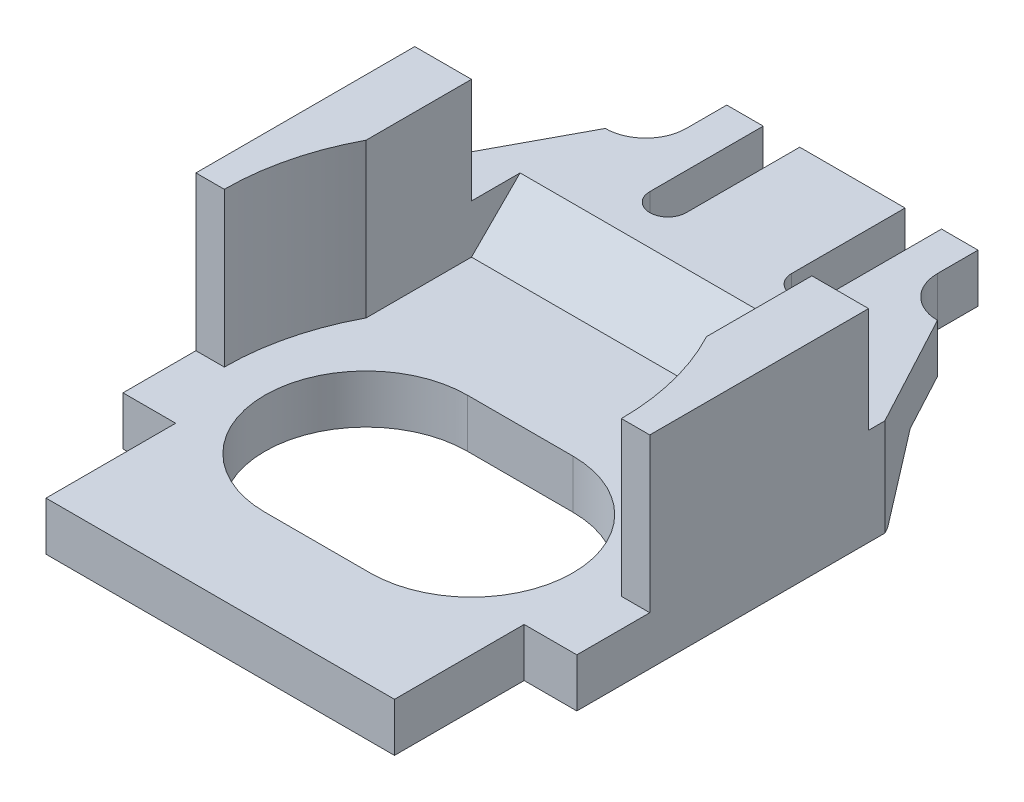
ISO-10303-21;
HEADER;
FILE_DESCRIPTION(('STEP AP214'),'2;1');
FILE_NAME('part.step','',(''),(''),'','','');
FILE_SCHEMA(('AUTOMOTIVE_DESIGN { 1 0 10303 214 1 1 1 1 }'));
ENDSEC;
DATA;
#1=APPLICATION_CONTEXT('core data for automotive mechanical design processes');
#2=APPLICATION_PROTOCOL_DEFINITION('international standard','automotive_design',2000,#1);
#3=PRODUCT_CONTEXT('',#1,'mechanical');
#4=PRODUCT('Part','Part','',(#3));
#5=PRODUCT_RELATED_PRODUCT_CATEGORY('part','',(#4));
#6=PRODUCT_DEFINITION_FORMATION('','',#4);
#7=PRODUCT_DEFINITION_CONTEXT('part definition',#1,'design');
#8=PRODUCT_DEFINITION('design','',#6,#7);
#9=PRODUCT_DEFINITION_SHAPE('','',#8);
#10=(LENGTH_UNIT() NAMED_UNIT(*) SI_UNIT(.MILLI.,.METRE.));
#11=(NAMED_UNIT(*) PLANE_ANGLE_UNIT() SI_UNIT($,.RADIAN.));
#12=(NAMED_UNIT(*) SI_UNIT($,.STERADIAN.) SOLID_ANGLE_UNIT());
#13=UNCERTAINTY_MEASURE_WITH_UNIT(LENGTH_MEASURE(1.E-05),#10,'distance_accuracy_value','');
#14=(GEOMETRIC_REPRESENTATION_CONTEXT(3) GLOBAL_UNCERTAINTY_ASSIGNED_CONTEXT((#13)) GLOBAL_UNIT_ASSIGNED_CONTEXT((#10,
#11,#12)) REPRESENTATION_CONTEXT('',''));
#15=CARTESIAN_POINT('',(0.,0.,0.));
#16=DIRECTION('',(0.,0.,1.));
#17=DIRECTION('',(1.,0.,0.));
#18=AXIS2_PLACEMENT_3D('',#15,#16,#17);
#19=CARTESIAN_POINT('',(-28.,0.,24.5));
#20=DIRECTION('',(0.,-1.,0.));
#21=DIRECTION('',(0.,0.,-1.));
#22=AXIS2_PLACEMENT_3D('',#19,#20,#21);
#23=PLANE('',#22);
#24=CARTESIAN_POINT('',(-6.5,0.,0.));
#25=DIRECTION('',(0.,-1.,0.));
#26=DIRECTION('',(0.,0.,-1.));
#27=AXIS2_PLACEMENT_3D('',#24,#25,#26);
#28=CIRCLE('',#27,12.5);
#29=CARTESIAN_POINT('',(-6.5,0.,12.5));
#30=VERTEX_POINT('',#29);
#31=CARTESIAN_POINT('',(-6.5,0.,-12.5));
#32=VERTEX_POINT('',#31);
#33=EDGE_CURVE('E332',#30,#32,#28,.T.);
#34=ORIENTED_EDGE('',*,*,#33,.T.);
#35=DIRECTION('',(1.,0.,0.));
#36=VECTOR('',#35,1.);
#37=CARTESIAN_POINT('',(-6.5,0.,-12.5));
#38=LINE('',#37,#36);
#39=CARTESIAN_POINT('',(6.5,0.,-12.5));
#40=VERTEX_POINT('',#39);
#41=EDGE_CURVE('E473',#32,#40,#38,.T.);
#42=ORIENTED_EDGE('',*,*,#41,.T.);
#43=CARTESIAN_POINT('',(6.5,0.,0.));
#44=DIRECTION('',(0.,-1.,0.));
#45=DIRECTION('',(0.,0.,-1.));
#46=AXIS2_PLACEMENT_3D('',#43,#44,#45);
#47=CIRCLE('',#46,12.5);
#48=CARTESIAN_POINT('',(6.5,0.,12.5));
#49=VERTEX_POINT('',#48);
#50=EDGE_CURVE('E325',#40,#49,#47,.T.);
#51=ORIENTED_EDGE('',*,*,#50,.T.);
#52=DIRECTION('',(-1.,0.,0.));
#53=VECTOR('',#52,1.);
#54=CARTESIAN_POINT('',(-6.5,0.,12.5));
#55=LINE('',#54,#53);
#56=EDGE_CURVE('E330',#49,#30,#55,.T.);
#57=ORIENTED_EDGE('',*,*,#56,.T.);
#58=EDGE_LOOP('',(#34,#42,#51,#57));
#59=FACE_BOUND('',#58,.T.);
#60=CARTESIAN_POINT('',(5.25,0.,-0.499999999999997));
#61=DIRECTION('',(0.,1.,0.));
#62=DIRECTION('',(0.,0.,-1.));
#63=AXIS2_PLACEMENT_3D('',#60,#61,#62);
#64=CIRCLE('',#63,29.75);
#65=CARTESIAN_POINT('',(-21.,0.,-14.5));
#66=VERTEX_POINT('',#65);
#67=CARTESIAN_POINT('',(-24.5,0.,-0.499999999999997));
#68=VERTEX_POINT('',#67);
#69=EDGE_CURVE('E307',#66,#68,#64,.T.);
#70=ORIENTED_EDGE('',*,*,#69,.T.);
#71=DIRECTION('',(-1.,0.,0.));
#72=VECTOR('',#71,1.);
#73=CARTESIAN_POINT('',(-28.,0.,-0.499999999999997));
#74=LINE('',#73,#72);
#75=CARTESIAN_POINT('',(-28.,0.,-0.499999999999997));
#76=VERTEX_POINT('',#75);
#77=EDGE_CURVE('E291',#68,#76,#74,.T.);
#78=ORIENTED_EDGE('',*,*,#77,.T.);
#79=DIRECTION('',(0.,0.,-1.));
#80=VECTOR('',#79,1.);
#81=CARTESIAN_POINT('',(-28.,0.,24.5));
#82=LINE('',#81,#80);
#83=CARTESIAN_POINT('',(-28.,0.,8.49999999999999));
#84=VERTEX_POINT('',#83);
#85=EDGE_CURVE('E303',#84,#76,#82,.T.);
#86=ORIENTED_EDGE('',*,*,#85,.F.);
#87=DIRECTION('',(-1.,0.,0.));
#88=VECTOR('',#87,1.);
#89=CARTESIAN_POINT('',(-28.,0.,8.49999999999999));
#90=LINE('',#89,#88);
#91=CARTESIAN_POINT('',(-21.5,0.,8.49999999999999));
#92=VERTEX_POINT('',#91);
#93=EDGE_CURVE('E343',#92,#84,#90,.T.);
#94=ORIENTED_EDGE('',*,*,#93,.F.);
#95=DIRECTION('',(0.,0.,-1.));
#96=VECTOR('',#95,1.);
#97=CARTESIAN_POINT('',(-21.5,0.,8.49999999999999));
#98=LINE('',#97,#96);
#99=CARTESIAN_POINT('',(-21.5,0.,24.5));
#100=VERTEX_POINT('',#99);
#101=EDGE_CURVE('E340',#100,#92,#98,.T.);
#102=ORIENTED_EDGE('',*,*,#101,.F.);
#103=DIRECTION('',(1.,0.,0.));
#104=VECTOR('',#103,1.);
#105=CARTESIAN_POINT('',(-28.,0.,24.5));
#106=LINE('',#105,#104);
#107=CARTESIAN_POINT('',(21.5,0.,24.5));
#108=VERTEX_POINT('',#107);
#109=EDGE_CURVE('E313',#100,#108,#106,.T.);
#110=ORIENTED_EDGE('',*,*,#109,.T.);
#111=DIRECTION('',(0.,0.,1.));
#112=VECTOR('',#111,1.);
#113=CARTESIAN_POINT('',(21.5,0.,8.49999999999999));
#114=LINE('',#113,#112);
#115=CARTESIAN_POINT('',(21.5,0.,8.49999999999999));
#116=VERTEX_POINT('',#115);
#117=EDGE_CURVE('E337',#116,#108,#114,.T.);
#118=ORIENTED_EDGE('',*,*,#117,.F.);
#119=DIRECTION('',(-1.,0.,0.));
#120=VECTOR('',#119,1.);
#121=CARTESIAN_POINT('',(28.,0.,8.49999999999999));
#122=LINE('',#121,#120);
#123=CARTESIAN_POINT('',(28.,0.,8.49999999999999));
#124=VERTEX_POINT('',#123);
#125=EDGE_CURVE('E334',#124,#116,#122,.T.);
#126=ORIENTED_EDGE('',*,*,#125,.F.);
#127=DIRECTION('',(0.,0.,-1.));
#128=VECTOR('',#127,1.);
#129=CARTESIAN_POINT('',(28.,0.,24.5));
#130=LINE('',#129,#128);
#131=CARTESIAN_POINT('',(28.,0.,-0.499999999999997));
#132=VERTEX_POINT('',#131);
#133=EDGE_CURVE('E314',#124,#132,#130,.T.);
#134=ORIENTED_EDGE('',*,*,#133,.T.);
#135=DIRECTION('',(1.,0.,0.));
#136=VECTOR('',#135,1.);
#137=CARTESIAN_POINT('',(28.,0.,-0.499999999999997));
#138=LINE('',#137,#136);
#139=CARTESIAN_POINT('',(24.5,0.,-0.499999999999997));
#140=VERTEX_POINT('',#139);
#141=EDGE_CURVE('E598',#140,#132,#138,.T.);
#142=ORIENTED_EDGE('',*,*,#141,.F.);
#143=CARTESIAN_POINT('',(-5.25,0.,-0.499999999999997));
#144=DIRECTION('',(0.,-1.,0.));
#145=DIRECTION('',(0.,0.,-1.));
#146=AXIS2_PLACEMENT_3D('',#143,#144,#145);
#147=CIRCLE('',#146,29.75);
#148=CARTESIAN_POINT('',(21.,0.,-14.5));
#149=VERTEX_POINT('',#148);
#150=EDGE_CURVE('E592',#149,#140,#147,.T.);
#151=ORIENTED_EDGE('',*,*,#150,.F.);
#152=DIRECTION('',(0.,0.,1.));
#153=VECTOR('',#152,1.);
#154=CARTESIAN_POINT('',(21.,0.,-14.5));
#155=LINE('',#154,#153);
#156=CARTESIAN_POINT('',(21.,0.,-27.5));
#157=VERTEX_POINT('',#156);
#158=EDGE_CURVE('E589',#157,#149,#155,.T.);
#159=ORIENTED_EDGE('',*,*,#158,.F.);
#160=DIRECTION('',(1.,0.,0.));
#161=VECTOR('',#160,1.);
#162=CARTESIAN_POINT('',(-28.,0.,-27.5));
#163=LINE('',#162,#161);
#164=CARTESIAN_POINT('',(-21.,0.,-27.5));
#165=VERTEX_POINT('',#164);
#166=EDGE_CURVE('E316',#165,#157,#163,.T.);
#167=ORIENTED_EDGE('',*,*,#166,.F.);
#168=DIRECTION('',(0.,0.,1.));
#169=VECTOR('',#168,1.);
#170=CARTESIAN_POINT('',(-21.,0.,-14.5));
#171=LINE('',#170,#169);
#172=EDGE_CURVE('E753',#165,#66,#171,.T.);
#173=ORIENTED_EDGE('',*,*,#172,.T.);
#174=EDGE_LOOP('',(#70,#78,#86,#94,#102,#110,#118,#126,#134,#142,#151,#159,#167,#173));
#175=FACE_BOUND('',#174,.T.);
#176=ADVANCED_FACE('F33',(#59,#175),#23,.F.);
#177=CARTESIAN_POINT('',(-8.75,6.,-39.5));
#178=DIRECTION('',(0.,-1.,0.));
#179=DIRECTION('',(0.,0.,-1.));
#180=AXIS2_PLACEMENT_3D('',#177,#178,#179);
#181=PLANE('',#180);
#182=DIRECTION('',(1.,0.,0.));
#183=VECTOR('',#182,1.);
#184=CARTESIAN_POINT('',(-8.75,6.,-33.5000000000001));
#185=LINE('',#184,#183);
#186=CARTESIAN_POINT('',(-21.,6.,-33.5000000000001));
#187=VERTEX_POINT('',#186);
#188=CARTESIAN_POINT('',(21.,6.,-33.5000000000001));
#189=VERTEX_POINT('',#188);
#190=EDGE_CURVE('E484',#187,#189,#185,.T.);
#191=ORIENTED_EDGE('',*,*,#190,.T.);
#192=DIRECTION('',(0.,0.,1.));
#193=VECTOR('',#192,1.);
#194=CARTESIAN_POINT('',(21.,6.,-39.5));
#195=LINE('',#194,#193);
#196=CARTESIAN_POINT('',(21.,6.,-27.5));
#197=VERTEX_POINT('',#196);
#198=EDGE_CURVE('E487',#189,#197,#195,.T.);
#199=ORIENTED_EDGE('',*,*,#198,.T.);
#200=DIRECTION('',(1.,0.,0.));
#201=VECTOR('',#200,1.);
#202=CARTESIAN_POINT('',(-28.,6.,-27.5));
#203=LINE('',#202,#201);
#204=CARTESIAN_POINT('',(28.,6.,-27.5));
#205=VERTEX_POINT('',#204);
#206=EDGE_CURVE('E326',#197,#205,#203,.T.);
#207=ORIENTED_EDGE('',*,*,#206,.T.);
#208=DIRECTION('',(0.,0.,-1.));
#209=VECTOR('',#208,1.);
#210=CARTESIAN_POINT('',(28.,6.,8.49999999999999));
#211=LINE('',#210,#209);
#212=CARTESIAN_POINT('',(28.,6.,-29.5));
#213=VERTEX_POINT('',#212);
#214=EDGE_CURVE('E392',#205,#213,#211,.T.);
#215=ORIENTED_EDGE('',*,*,#214,.T.);
#216=DIRECTION('',(-0.472221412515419,0.,-0.881479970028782));
#217=VECTOR('',#216,1.);
#218=CARTESIAN_POINT('',(28.,6.,-29.5));
#219=LINE('',#218,#217);
#220=CARTESIAN_POINT('',(20.5,6.,-43.5));
#221=VERTEX_POINT('',#220);
#222=EDGE_CURVE('E394',#213,#221,#219,.T.);
#223=ORIENTED_EDGE('',*,*,#222,.T.);
#224=CARTESIAN_POINT('',(20.5,6.,-48.5));
#225=DIRECTION('',(0.,-1.,0.));
#226=DIRECTION('',(0.,0.,-1.));
#227=AXIS2_PLACEMENT_3D('',#224,#225,#226);
#228=CIRCLE('',#227,5.);
#229=CARTESIAN_POINT('',(15.5,6.,-48.5));
#230=VERTEX_POINT('',#229);
#231=EDGE_CURVE('E11',#221,#230,#228,.T.);
#232=ORIENTED_EDGE('',*,*,#231,.T.);
#233=DIRECTION('',(0.,0.,-1.));
#234=VECTOR('',#233,1.);
#235=CARTESIAN_POINT('',(15.5,6.,-43.5));
#236=LINE('',#235,#234);
#237=CARTESIAN_POINT('',(15.5,6.,-53.5));
#238=VERTEX_POINT('',#237);
#239=EDGE_CURVE('E396',#230,#238,#236,.T.);
#240=ORIENTED_EDGE('',*,*,#239,.T.);
#241=DIRECTION('',(-1.,0.,0.));
#242=VECTOR('',#241,1.);
#243=CARTESIAN_POINT('',(11.,6.,-53.5));
#244=LINE('',#243,#242);
#245=CARTESIAN_POINT('',(11.,6.,-53.5));
#246=VERTEX_POINT('',#245);
#247=EDGE_CURVE('E398',#238,#246,#244,.T.);
#248=ORIENTED_EDGE('',*,*,#247,.T.);
#249=DIRECTION('',(0.,0.,1.));
#250=VECTOR('',#249,1.);
#251=CARTESIAN_POINT('',(11.,6.,-53.5));
#252=LINE('',#251,#250);
#253=CARTESIAN_POINT('',(11.,6.,-39.5));
#254=VERTEX_POINT('',#253);
#255=EDGE_CURVE('E400',#246,#254,#252,.T.);
#256=ORIENTED_EDGE('',*,*,#255,.T.);
#257=CARTESIAN_POINT('',(8.75,6.,-39.5));
#258=DIRECTION('',(0.,-1.,0.));
#259=DIRECTION('',(0.,0.,1.));
#260=AXIS2_PLACEMENT_3D('',#257,#258,#259);
#261=CIRCLE('',#260,2.25);
#262=CARTESIAN_POINT('',(6.5,6.,-39.5));
#263=VERTEX_POINT('',#262);
#264=EDGE_CURVE('E402',#254,#263,#261,.T.);
#265=ORIENTED_EDGE('',*,*,#264,.T.);
#266=DIRECTION('',(0.,0.,-1.));
#267=VECTOR('',#266,1.);
#268=CARTESIAN_POINT('',(6.5,6.,-53.5));
#269=LINE('',#268,#267);
#270=CARTESIAN_POINT('',(6.5,6.,-53.5));
#271=VERTEX_POINT('',#270);
#272=EDGE_CURVE('E404',#263,#271,#269,.T.);
#273=ORIENTED_EDGE('',*,*,#272,.T.);
#274=DIRECTION('',(-1.,0.,0.));
#275=VECTOR('',#274,1.);
#276=CARTESIAN_POINT('',(6.5,6.,-53.5));
#277=LINE('',#276,#275);
#278=CARTESIAN_POINT('',(-6.5,6.,-53.5));
#279=VERTEX_POINT('',#278);
#280=EDGE_CURVE('E406',#271,#279,#277,.T.);
#281=ORIENTED_EDGE('',*,*,#280,.T.);
#282=DIRECTION('',(0.,0.,1.));
#283=VECTOR('',#282,1.);
#284=CARTESIAN_POINT('',(-6.5,6.,-53.5));
#285=LINE('',#284,#283);
#286=CARTESIAN_POINT('',(-6.5,6.,-39.5));
#287=VERTEX_POINT('',#286);
#288=EDGE_CURVE('E408',#279,#287,#285,.T.);
#289=ORIENTED_EDGE('',*,*,#288,.T.);
#290=CARTESIAN_POINT('',(-8.75,6.,-39.5));
#291=DIRECTION('',(0.,-1.,0.));
#292=DIRECTION('',(0.,0.,-1.));
#293=AXIS2_PLACEMENT_3D('',#290,#291,#292);
#294=CIRCLE('',#293,2.25);
#295=CARTESIAN_POINT('',(-11.,6.,-39.5));
#296=VERTEX_POINT('',#295);
#297=EDGE_CURVE('E410',#287,#296,#294,.T.);
#298=ORIENTED_EDGE('',*,*,#297,.T.);
#299=DIRECTION('',(0.,0.,-1.));
#300=VECTOR('',#299,1.);
#301=CARTESIAN_POINT('',(-11.,6.,-53.5));
#302=LINE('',#301,#300);
#303=CARTESIAN_POINT('',(-11.,6.,-53.5));
#304=VERTEX_POINT('',#303);
#305=EDGE_CURVE('E412',#296,#304,#302,.T.);
#306=ORIENTED_EDGE('',*,*,#305,.T.);
#307=DIRECTION('',(-1.,0.,0.));
#308=VECTOR('',#307,1.);
#309=CARTESIAN_POINT('',(-15.5,6.,-53.5));
#310=LINE('',#309,#308);
#311=CARTESIAN_POINT('',(-15.5,6.,-53.5));
#312=VERTEX_POINT('',#311);
#313=EDGE_CURVE('E414',#304,#312,#310,.T.);
#314=ORIENTED_EDGE('',*,*,#313,.T.);
#315=DIRECTION('',(0.,0.,1.));
#316=VECTOR('',#315,1.);
#317=CARTESIAN_POINT('',(-15.5,6.,-43.5));
#318=LINE('',#317,#316);
#319=CARTESIAN_POINT('',(-15.5,6.,-48.5));
#320=VERTEX_POINT('',#319);
#321=EDGE_CURVE('E416',#312,#320,#318,.T.);
#322=ORIENTED_EDGE('',*,*,#321,.T.);
#323=CARTESIAN_POINT('',(-20.5,6.,-48.5));
#324=DIRECTION('',(0.,-1.,0.));
#325=DIRECTION('',(0.,0.,-1.));
#326=AXIS2_PLACEMENT_3D('',#323,#324,#325);
#327=CIRCLE('',#326,5.);
#328=CARTESIAN_POINT('',(-20.5,6.,-43.5));
#329=VERTEX_POINT('',#328);
#330=EDGE_CURVE('E499',#320,#329,#327,.T.);
#331=ORIENTED_EDGE('',*,*,#330,.T.);
#332=DIRECTION('',(-0.472221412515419,0.,0.881479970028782));
#333=VECTOR('',#332,1.);
#334=CARTESIAN_POINT('',(-28.,6.,-29.5));
#335=LINE('',#334,#333);
#336=CARTESIAN_POINT('',(-28.,6.,-29.5));
#337=VERTEX_POINT('',#336);
#338=EDGE_CURVE('E419',#329,#337,#335,.T.);
#339=ORIENTED_EDGE('',*,*,#338,.T.);
#340=DIRECTION('',(0.,0.,1.));
#341=VECTOR('',#340,1.);
#342=CARTESIAN_POINT('',(-28.,6.,8.49999999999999));
#343=LINE('',#342,#341);
#344=CARTESIAN_POINT('',(-28.,6.,-27.5));
#345=VERTEX_POINT('',#344);
#346=EDGE_CURVE('E389',#337,#345,#343,.T.);
#347=ORIENTED_EDGE('',*,*,#346,.T.);
#348=CARTESIAN_POINT('',(-21.,6.,-27.5));
#349=VERTEX_POINT('',#348);
#350=EDGE_CURVE('E322',#345,#349,#203,.T.);
#351=ORIENTED_EDGE('',*,*,#350,.T.);
#352=DIRECTION('',(0.,0.,-1.));
#353=VECTOR('',#352,1.);
#354=CARTESIAN_POINT('',(-21.,6.,-14.5));
#355=LINE('',#354,#353);
#356=EDGE_CURVE('E481',#349,#187,#355,.T.);
#357=ORIENTED_EDGE('',*,*,#356,.T.);
#358=EDGE_LOOP('',(#191,#199,#207,#215,#223,#232,#240,#248,#256,#265,#273,#281,#289,#298,#306,
#314,#322,#331,#339,#347,#351,#357));
#359=FACE_BOUND('',#358,.T.);
#360=ADVANCED_FACE('F519',(#359),#181,.F.);
#361=CARTESIAN_POINT('',(-8.75,-6.,-39.5));
#362=DIRECTION('',(0.,-1.,0.));
#363=DIRECTION('',(0.,0.,-1.));
#364=AXIS2_PLACEMENT_3D('',#361,#362,#363);
#365=PLANE('',#364);
#366=DIRECTION('',(1.,0.,0.));
#367=VECTOR('',#366,1.);
#368=CARTESIAN_POINT('',(-28.,-6.,-30.25));
#369=LINE('',#368,#367);
#370=CARTESIAN_POINT('',(-27.5982142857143,-6.,-30.25));
#371=VERTEX_POINT('',#370);
#372=CARTESIAN_POINT('',(27.5982142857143,-6.,-30.25));
#373=VERTEX_POINT('',#372);
#374=EDGE_CURVE('E627',#371,#373,#369,.T.);
#375=ORIENTED_EDGE('',*,*,#374,.T.);
#376=DIRECTION('',(-0.472221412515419,0.,-0.881479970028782));
#377=VECTOR('',#376,1.);
#378=CARTESIAN_POINT('',(28.,-6.,-29.5));
#379=LINE('',#378,#377);
#380=CARTESIAN_POINT('',(28.,-6.,-29.5));
#381=VERTEX_POINT('',#380);
#382=EDGE_CURVE('E384',#381,#373,#379,.T.);
#383=ORIENTED_EDGE('',*,*,#382,.F.);
#384=DIRECTION('',(0.,0.,-1.));
#385=VECTOR('',#384,1.);
#386=CARTESIAN_POINT('',(28.,-6.,8.49999999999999));
#387=LINE('',#386,#385);
#388=CARTESIAN_POINT('',(28.,-6.,8.49999999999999));
#389=VERTEX_POINT('',#388);
#390=EDGE_CURVE('E382',#389,#381,#387,.T.);
#391=ORIENTED_EDGE('',*,*,#390,.F.);
#392=DIRECTION('',(1.,0.,0.));
#393=VECTOR('',#392,1.);
#394=CARTESIAN_POINT('',(28.,-6.,8.49999999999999));
#395=LINE('',#394,#393);
#396=CARTESIAN_POINT('',(21.5,-6.,8.49999999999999));
#397=VERTEX_POINT('',#396);
#398=EDGE_CURVE('E379',#397,#389,#395,.T.);
#399=ORIENTED_EDGE('',*,*,#398,.F.);
#400=DIRECTION('',(0.,0.,-1.));
#401=VECTOR('',#400,1.);
#402=CARTESIAN_POINT('',(21.5,-6.,8.49999999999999));
#403=LINE('',#402,#401);
#404=CARTESIAN_POINT('',(21.5,-6.,24.5));
#405=VERTEX_POINT('',#404);
#406=EDGE_CURVE('E376',#405,#397,#403,.T.);
#407=ORIENTED_EDGE('',*,*,#406,.F.);
#408=DIRECTION('',(1.,0.,0.));
#409=VECTOR('',#408,1.);
#410=CARTESIAN_POINT('',(-21.5,-6.,24.5));
#411=LINE('',#410,#409);
#412=CARTESIAN_POINT('',(-21.5,-6.,24.5));
#413=VERTEX_POINT('',#412);
#414=EDGE_CURVE('E373',#413,#405,#411,.T.);
#415=ORIENTED_EDGE('',*,*,#414,.F.);
#416=DIRECTION('',(0.,0.,1.));
#417=VECTOR('',#416,1.);
#418=CARTESIAN_POINT('',(-21.5,-6.,8.49999999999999));
#419=LINE('',#418,#417);
#420=CARTESIAN_POINT('',(-21.5,-6.,8.49999999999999));
#421=VERTEX_POINT('',#420);
#422=EDGE_CURVE('E370',#421,#413,#419,.T.);
#423=ORIENTED_EDGE('',*,*,#422,.F.);
#424=DIRECTION('',(1.,0.,0.));
#425=VECTOR('',#424,1.);
#426=CARTESIAN_POINT('',(-28.,-6.,8.49999999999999));
#427=LINE('',#426,#425);
#428=CARTESIAN_POINT('',(-28.,-6.,8.49999999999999));
#429=VERTEX_POINT('',#428);
#430=EDGE_CURVE('E367',#429,#421,#427,.T.);
#431=ORIENTED_EDGE('',*,*,#430,.F.);
#432=DIRECTION('',(0.,0.,1.));
#433=VECTOR('',#432,1.);
#434=CARTESIAN_POINT('',(-28.,-6.,8.49999999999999));
#435=LINE('',#434,#433);
#436=CARTESIAN_POINT('',(-28.,-6.,-29.5));
#437=VERTEX_POINT('',#436);
#438=EDGE_CURVE('E365',#437,#429,#435,.T.);
#439=ORIENTED_EDGE('',*,*,#438,.F.);
#440=DIRECTION('',(-0.472221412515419,0.,0.881479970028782));
#441=VECTOR('',#440,1.);
#442=CARTESIAN_POINT('',(-28.,-6.,-29.5));
#443=LINE('',#442,#441);
#444=EDGE_CURVE('E387',#371,#437,#443,.T.);
#445=ORIENTED_EDGE('',*,*,#444,.F.);
#446=EDGE_LOOP('',(#375,#383,#391,#399,#407,#415,#423,#431,#439,#445));
#447=FACE_BOUND('',#446,.T.);
#448=DIRECTION('',(-1.,0.,0.));
#449=VECTOR('',#448,1.);
#450=CARTESIAN_POINT('',(-6.5,-6.,-12.5));
#451=LINE('',#450,#449);
#452=CARTESIAN_POINT('',(6.5,-6.,-12.5));
#453=VERTEX_POINT('',#452);
#454=CARTESIAN_POINT('',(-6.5,-6.,-12.5));
#455=VERTEX_POINT('',#454);
#456=EDGE_CURVE('E354',#453,#455,#451,.T.);
#457=ORIENTED_EDGE('',*,*,#456,.T.);
#458=CARTESIAN_POINT('',(-6.5,-6.,0.));
#459=DIRECTION('',(0.,1.,0.));
#460=DIRECTION('',(0.,0.,1.));
#461=AXIS2_PLACEMENT_3D('',#458,#459,#460);
#462=CIRCLE('',#461,12.5);
#463=CARTESIAN_POINT('',(-6.5,-6.,12.5));
#464=VERTEX_POINT('',#463);
#465=EDGE_CURVE('E345',#455,#464,#462,.T.);
#466=ORIENTED_EDGE('',*,*,#465,.T.);
#467=DIRECTION('',(1.,0.,0.));
#468=VECTOR('',#467,1.);
#469=CARTESIAN_POINT('',(-6.5,-6.,12.5));
#470=LINE('',#469,#468);
#471=CARTESIAN_POINT('',(6.5,-6.,12.5));
#472=VERTEX_POINT('',#471);
#473=EDGE_CURVE('E348',#464,#472,#470,.T.);
#474=ORIENTED_EDGE('',*,*,#473,.T.);
#475=CARTESIAN_POINT('',(6.5,-6.,0.));
#476=DIRECTION('',(0.,1.,0.));
#477=DIRECTION('',(0.,0.,-1.));
#478=AXIS2_PLACEMENT_3D('',#475,#476,#477);
#479=CIRCLE('',#478,12.5);
#480=EDGE_CURVE('E351',#472,#453,#479,.T.);
#481=ORIENTED_EDGE('',*,*,#480,.T.);
#482=EDGE_LOOP('',(#457,#466,#474,#481));
#483=FACE_BOUND('',#482,.T.);
#484=ADVANCED_FACE('F661',(#447,#483),#365,.T.);
#485=CARTESIAN_POINT('',(-28.,6.,8.49999999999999));
#486=DIRECTION('',(1.,0.,0.));
#487=DIRECTION('',(0.,0.,-1.));
#488=AXIS2_PLACEMENT_3D('',#485,#486,#487);
#489=PLANE('',#488);
#490=DIRECTION('',(0.,-1.,0.));
#491=VECTOR('',#490,1.);
#492=CARTESIAN_POINT('',(-28.,19.,-27.5));
#493=LINE('',#492,#491);
#494=CARTESIAN_POINT('',(-28.,19.,-27.5));
#495=VERTEX_POINT('',#494);
#496=EDGE_CURVE('E299',#495,#345,#493,.T.);
#497=ORIENTED_EDGE('',*,*,#496,.T.);
#498=ORIENTED_EDGE('',*,*,#346,.F.);
#499=DIRECTION('',(0.,-1.,0.));
#500=VECTOR('',#499,1.);
#501=CARTESIAN_POINT('',(-28.,6.,-29.5));
#502=LINE('',#501,#500);
#503=EDGE_CURVE('E421',#337,#437,#502,.T.);
#504=ORIENTED_EDGE('',*,*,#503,.T.);
#505=ORIENTED_EDGE('',*,*,#438,.T.);
#506=DIRECTION('',(0.,-1.,0.));
#507=VECTOR('',#506,1.);
#508=CARTESIAN_POINT('',(-28.,6.,8.49999999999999));
#509=LINE('',#508,#507);
#510=EDGE_CURVE('E312',#84,#429,#509,.T.);
#511=ORIENTED_EDGE('',*,*,#510,.F.);
#512=ORIENTED_EDGE('',*,*,#85,.T.);
#513=DIRECTION('',(0.,-1.,0.));
#514=VECTOR('',#513,1.);
#515=CARTESIAN_POINT('',(-28.,19.,-0.499999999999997));
#516=LINE('',#515,#514);
#517=CARTESIAN_POINT('',(-28.,19.,-0.499999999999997));
#518=VERTEX_POINT('',#517);
#519=EDGE_CURVE('E288',#518,#76,#516,.T.);
#520=ORIENTED_EDGE('',*,*,#519,.F.);
#521=DIRECTION('',(0.,0.,-1.));
#522=VECTOR('',#521,1.);
#523=CARTESIAN_POINT('',(-28.,19.,-0.499999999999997));
#524=LINE('',#523,#522);
#525=EDGE_CURVE('E585',#518,#495,#524,.T.);
#526=ORIENTED_EDGE('',*,*,#525,.T.);
#527=EDGE_LOOP('',(#497,#498,#504,#505,#511,#512,#520,#526));
#528=FACE_BOUND('',#527,.T.);
#529=ADVANCED_FACE('F35',(#528),#489,.F.);
#530=CARTESIAN_POINT('',(-28.,6.,8.49999999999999));
#531=DIRECTION('',(0.,0.,-1.));
#532=DIRECTION('',(-1.,0.,0.));
#533=AXIS2_PLACEMENT_3D('',#530,#531,#532);
#534=PLANE('',#533);
#535=DIRECTION('',(0.,-1.,0.));
#536=VECTOR('',#535,1.);
#537=CARTESIAN_POINT('',(-21.5,6.,8.49999999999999));
#538=LINE('',#537,#536);
#539=EDGE_CURVE('E470',#92,#421,#538,.T.);
#540=ORIENTED_EDGE('',*,*,#539,.F.);
#541=ORIENTED_EDGE('',*,*,#93,.T.);
#542=ORIENTED_EDGE('',*,*,#510,.T.);
#543=ORIENTED_EDGE('',*,*,#430,.T.);
#544=EDGE_LOOP('',(#540,#541,#542,#543));
#545=FACE_BOUND('',#544,.T.);
#546=ADVANCED_FACE('F687',(#545),#534,.F.);
#547=CARTESIAN_POINT('',(-21.5,6.,8.49999999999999));
#548=DIRECTION('',(1.,0.,0.));
#549=DIRECTION('',(0.,0.,-1.));
#550=AXIS2_PLACEMENT_3D('',#547,#548,#549);
#551=PLANE('',#550);
#552=DIRECTION('',(0.,-1.,0.));
#553=VECTOR('',#552,1.);
#554=CARTESIAN_POINT('',(-21.5,6.,24.5));
#555=LINE('',#554,#553);
#556=EDGE_CURVE('E468',#100,#413,#555,.T.);
#557=ORIENTED_EDGE('',*,*,#556,.F.);
#558=ORIENTED_EDGE('',*,*,#101,.T.);
#559=ORIENTED_EDGE('',*,*,#539,.T.);
#560=ORIENTED_EDGE('',*,*,#422,.T.);
#561=EDGE_LOOP('',(#557,#558,#559,#560));
#562=FACE_BOUND('',#561,.T.);
#563=ADVANCED_FACE('F729',(#562),#551,.F.);
#564=CARTESIAN_POINT('',(-21.5,6.,24.5));
#565=DIRECTION('',(0.,0.,-1.));
#566=DIRECTION('',(-1.,0.,0.));
#567=AXIS2_PLACEMENT_3D('',#564,#565,#566);
#568=PLANE('',#567);
#569=DIRECTION('',(0.,-1.,0.));
#570=VECTOR('',#569,1.);
#571=CARTESIAN_POINT('',(21.5,6.,24.5));
#572=LINE('',#571,#570);
#573=EDGE_CURVE('E466',#108,#405,#572,.T.);
#574=ORIENTED_EDGE('',*,*,#573,.F.);
#575=ORIENTED_EDGE('',*,*,#109,.F.);
#576=ORIENTED_EDGE('',*,*,#556,.T.);
#577=ORIENTED_EDGE('',*,*,#414,.T.);
#578=EDGE_LOOP('',(#574,#575,#576,#577));
#579=FACE_BOUND('',#578,.T.);
#580=ADVANCED_FACE('F724',(#579),#568,.F.);
#581=CARTESIAN_POINT('',(21.5,6.,8.49999999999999));
#582=DIRECTION('',(-1.,0.,0.));
#583=DIRECTION('',(0.,0.,1.));
#584=AXIS2_PLACEMENT_3D('',#581,#582,#583);
#585=PLANE('',#584);
#586=DIRECTION('',(0.,-1.,0.));
#587=VECTOR('',#586,1.);
#588=CARTESIAN_POINT('',(21.5,6.,8.49999999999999));
#589=LINE('',#588,#587);
#590=EDGE_CURVE('E464',#116,#397,#589,.T.);
#591=ORIENTED_EDGE('',*,*,#590,.F.);
#592=ORIENTED_EDGE('',*,*,#117,.T.);
#593=ORIENTED_EDGE('',*,*,#573,.T.);
#594=ORIENTED_EDGE('',*,*,#406,.T.);
#595=EDGE_LOOP('',(#591,#592,#593,#594));
#596=FACE_BOUND('',#595,.T.);
#597=ADVANCED_FACE('F720',(#596),#585,.F.);
#598=CARTESIAN_POINT('',(28.,6.,8.49999999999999));
#599=DIRECTION('',(0.,0.,-1.));
#600=DIRECTION('',(-1.,0.,0.));
#601=AXIS2_PLACEMENT_3D('',#598,#599,#600);
#602=PLANE('',#601);
#603=DIRECTION('',(0.,-1.,0.));
#604=VECTOR('',#603,1.);
#605=CARTESIAN_POINT('',(28.,6.,8.49999999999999));
#606=LINE('',#605,#604);
#607=EDGE_CURVE('E462',#124,#389,#606,.T.);
#608=ORIENTED_EDGE('',*,*,#607,.F.);
#609=ORIENTED_EDGE('',*,*,#125,.T.);
#610=ORIENTED_EDGE('',*,*,#590,.T.);
#611=ORIENTED_EDGE('',*,*,#398,.T.);
#612=EDGE_LOOP('',(#608,#609,#610,#611));
#613=FACE_BOUND('',#612,.T.);
#614=ADVANCED_FACE('F717',(#613),#602,.F.);
#615=CARTESIAN_POINT('',(28.,6.,8.49999999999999));
#616=DIRECTION('',(-1.,0.,0.));
#617=DIRECTION('',(0.,0.,1.));
#618=AXIS2_PLACEMENT_3D('',#615,#616,#617);
#619=PLANE('',#618);
#620=ORIENTED_EDGE('',*,*,#214,.F.);
#621=DIRECTION('',(0.,-1.,0.));
#622=VECTOR('',#621,1.);
#623=CARTESIAN_POINT('',(28.,19.,-27.5));
#624=LINE('',#623,#622);
#625=CARTESIAN_POINT('',(28.,19.,-27.5));
#626=VERTEX_POINT('',#625);
#627=EDGE_CURVE('E612',#626,#205,#624,.T.);
#628=ORIENTED_EDGE('',*,*,#627,.F.);
#629=DIRECTION('',(0.,0.,-1.));
#630=VECTOR('',#629,1.);
#631=CARTESIAN_POINT('',(28.,19.,-0.499999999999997));
#632=LINE('',#631,#630);
#633=CARTESIAN_POINT('',(28.,19.,-0.499999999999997));
#634=VERTEX_POINT('',#633);
#635=EDGE_CURVE('E610',#634,#626,#632,.T.);
#636=ORIENTED_EDGE('',*,*,#635,.F.);
#637=DIRECTION('',(0.,-1.,0.));
#638=VECTOR('',#637,1.);
#639=CARTESIAN_POINT('',(28.,19.,-0.499999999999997));
#640=LINE('',#639,#638);
#641=EDGE_CURVE('E615',#634,#132,#640,.T.);
#642=ORIENTED_EDGE('',*,*,#641,.T.);
#643=ORIENTED_EDGE('',*,*,#133,.F.);
#644=ORIENTED_EDGE('',*,*,#607,.T.);
#645=ORIENTED_EDGE('',*,*,#390,.T.);
#646=DIRECTION('',(0.,-1.,0.));
#647=VECTOR('',#646,1.);
#648=CARTESIAN_POINT('',(28.,6.,-29.5));
#649=LINE('',#648,#647);
#650=EDGE_CURVE('E459',#213,#381,#649,.T.);
#651=ORIENTED_EDGE('',*,*,#650,.F.);
#652=EDGE_LOOP('',(#620,#628,#636,#642,#643,#644,#645,#651));
#653=FACE_BOUND('',#652,.T.);
#654=ADVANCED_FACE('F708',(#653),#619,.F.);
#655=CARTESIAN_POINT('',(28.,6.,-29.5));
#656=DIRECTION('',(-0.881479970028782,0.,0.472221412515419));
#657=DIRECTION('',(0.472221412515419,0.,0.881479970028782));
#658=AXIS2_PLACEMENT_3D('',#655,#656,#657);
#659=PLANE('',#658);
#660=ORIENTED_EDGE('',*,*,#382,.T.);
#661=DIRECTION('',(-0.354242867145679,0.66125335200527,-0.661253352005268));
#662=VECTOR('',#661,1.);
#663=CARTESIAN_POINT('',(25.0133853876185,-1.17498605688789,-35.0750139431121));
#664=LINE('',#663,#662);
#665=CARTESIAN_POINT('',(24.3839285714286,0.,-36.25));
#666=VERTEX_POINT('',#665);
#667=EDGE_CURVE('E318',#373,#666,#664,.T.);
#668=ORIENTED_EDGE('',*,*,#667,.T.);
#669=DIRECTION('',(-0.472221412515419,0.,-0.881479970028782));
#670=VECTOR('',#669,1.);
#671=CARTESIAN_POINT('',(28.,0.,-29.5));
#672=LINE('',#671,#670);
#673=CARTESIAN_POINT('',(20.5,0.,-43.5));
#674=VERTEX_POINT('',#673);
#675=EDGE_CURVE('E504',#666,#674,#672,.T.);
#676=ORIENTED_EDGE('',*,*,#675,.T.);
#677=DIRECTION('',(0.,-1.,0.));
#678=VECTOR('',#677,1.);
#679=CARTESIAN_POINT('',(20.5,6.,-43.5));
#680=LINE('',#679,#678);
#681=EDGE_CURVE('E457',#221,#674,#680,.T.);
#682=ORIENTED_EDGE('',*,*,#681,.F.);
#683=ORIENTED_EDGE('',*,*,#222,.F.);
#684=ORIENTED_EDGE('',*,*,#650,.T.);
#685=EDGE_LOOP('',(#660,#668,#676,#682,#683,#684));
#686=FACE_BOUND('',#685,.T.);
#687=ADVANCED_FACE('F511',(#686),#659,.F.);
#688=CARTESIAN_POINT('',(15.5,6.,-43.5));
#689=DIRECTION('',(-1.,0.,0.));
#690=DIRECTION('',(0.,0.,1.));
#691=AXIS2_PLACEMENT_3D('',#688,#689,#690);
#692=PLANE('',#691);
#693=ORIENTED_EDGE('',*,*,#239,.F.);
#694=DIRECTION('',(0.,-1.,0.));
#695=VECTOR('',#694,1.);
#696=CARTESIAN_POINT('',(15.5,6.,-48.5));
#697=LINE('',#696,#695);
#698=CARTESIAN_POINT('',(15.5,0.,-48.5));
#699=VERTEX_POINT('',#698);
#700=EDGE_CURVE('E495',#230,#699,#697,.T.);
#701=ORIENTED_EDGE('',*,*,#700,.T.);
#702=DIRECTION('',(0.,0.,-1.));
#703=VECTOR('',#702,1.);
#704=CARTESIAN_POINT('',(15.5,0.,-43.5));
#705=LINE('',#704,#703);
#706=CARTESIAN_POINT('',(15.5,0.,-53.5));
#707=VERTEX_POINT('',#706);
#708=EDGE_CURVE('E507',#699,#707,#705,.T.);
#709=ORIENTED_EDGE('',*,*,#708,.T.);
#710=DIRECTION('',(0.,-1.,0.));
#711=VECTOR('',#710,1.);
#712=CARTESIAN_POINT('',(15.5,6.,-53.5));
#713=LINE('',#712,#711);
#714=EDGE_CURVE('E454',#238,#707,#713,.T.);
#715=ORIENTED_EDGE('',*,*,#714,.F.);
#716=EDGE_LOOP('',(#693,#701,#709,#715));
#717=FACE_BOUND('',#716,.T.);
#718=ADVANCED_FACE('F516',(#717),#692,.F.);
#719=CARTESIAN_POINT('',(11.,6.,-53.5));
#720=DIRECTION('',(0.,0.,1.));
#721=DIRECTION('',(1.,0.,0.));
#722=AXIS2_PLACEMENT_3D('',#719,#720,#721);
#723=PLANE('',#722);
#724=ORIENTED_EDGE('',*,*,#714,.T.);
#725=DIRECTION('',(1.,0.,0.));
#726=VECTOR('',#725,1.);
#727=CARTESIAN_POINT('',(-28.,0.,-53.5));
#728=LINE('',#727,#726);
#729=CARTESIAN_POINT('',(11.,0.,-53.5));
#730=VERTEX_POINT('',#729);
#731=EDGE_CURVE('E526',#730,#707,#728,.T.);
#732=ORIENTED_EDGE('',*,*,#731,.F.);
#733=DIRECTION('',(0.,-1.,0.));
#734=VECTOR('',#733,1.);
#735=CARTESIAN_POINT('',(11.,6.,-53.5));
#736=LINE('',#735,#734);
#737=EDGE_CURVE('E451',#246,#730,#736,.T.);
#738=ORIENTED_EDGE('',*,*,#737,.F.);
#739=ORIENTED_EDGE('',*,*,#247,.F.);
#740=EDGE_LOOP('',(#724,#732,#738,#739));
#741=FACE_BOUND('',#740,.T.);
#742=ADVANCED_FACE('F525',(#741),#723,.F.);
#743=CARTESIAN_POINT('',(11.,6.,-53.5));
#744=DIRECTION('',(1.,0.,0.));
#745=DIRECTION('',(0.,0.,-1.));
#746=AXIS2_PLACEMENT_3D('',#743,#744,#745);
#747=PLANE('',#746);
#748=ORIENTED_EDGE('',*,*,#737,.T.);
#749=DIRECTION('',(0.,0.,1.));
#750=VECTOR('',#749,1.);
#751=CARTESIAN_POINT('',(11.,0.,-53.5));
#752=LINE('',#751,#750);
#753=CARTESIAN_POINT('',(11.,0.,-39.5));
#754=VERTEX_POINT('',#753);
#755=EDGE_CURVE('E531',#730,#754,#752,.T.);
#756=ORIENTED_EDGE('',*,*,#755,.T.);
#757=DIRECTION('',(0.,-1.,0.));
#758=VECTOR('',#757,1.);
#759=CARTESIAN_POINT('',(11.,6.,-39.5));
#760=LINE('',#759,#758);
#761=EDGE_CURVE('E448',#254,#754,#760,.T.);
#762=ORIENTED_EDGE('',*,*,#761,.F.);
#763=ORIENTED_EDGE('',*,*,#255,.F.);
#764=EDGE_LOOP('',(#748,#756,#762,#763));
#765=FACE_BOUND('',#764,.T.);
#766=ADVANCED_FACE('F529',(#765),#747,.F.);
#767=CARTESIAN_POINT('',(8.75,6.,-39.5));
#768=DIRECTION('',(0.,-1.,0.));
#769=DIRECTION('',(0.,0.,-1.));
#770=AXIS2_PLACEMENT_3D('',#767,#768,#769);
#771=CYLINDRICAL_SURFACE('',#770,2.25);
#772=ORIENTED_EDGE('',*,*,#761,.T.);
#773=CARTESIAN_POINT('',(8.75,0.,-39.5));
#774=DIRECTION('',(0.,1.,0.));
#775=DIRECTION('',(0.,0.,1.));
#776=AXIS2_PLACEMENT_3D('',#773,#774,#775);
#777=CIRCLE('',#776,2.25);
#778=CARTESIAN_POINT('',(6.5,0.,-39.5));
#779=VERTEX_POINT('',#778);
#780=EDGE_CURVE('E642',#754,#779,#777,.F.);
#781=ORIENTED_EDGE('',*,*,#780,.T.);
#782=DIRECTION('',(0.,-1.,0.));
#783=VECTOR('',#782,1.);
#784=CARTESIAN_POINT('',(6.5,6.,-39.5));
#785=LINE('',#784,#783);
#786=EDGE_CURVE('E445',#263,#779,#785,.T.);
#787=ORIENTED_EDGE('',*,*,#786,.F.);
#788=ORIENTED_EDGE('',*,*,#264,.F.);
#789=EDGE_LOOP('',(#772,#781,#787,#788));
#790=FACE_BOUND('',#789,.T.);
#791=ADVANCED_FACE('F535',(#790),#771,.F.);
#792=CARTESIAN_POINT('',(6.5,6.,-53.5));
#793=DIRECTION('',(-1.,0.,0.));
#794=DIRECTION('',(0.,0.,1.));
#795=AXIS2_PLACEMENT_3D('',#792,#793,#794);
#796=PLANE('',#795);
#797=ORIENTED_EDGE('',*,*,#786,.T.);
#798=DIRECTION('',(0.,0.,-1.));
#799=VECTOR('',#798,1.);
#800=CARTESIAN_POINT('',(6.5,0.,-53.5));
#801=LINE('',#800,#799);
#802=CARTESIAN_POINT('',(6.5,0.,-53.5));
#803=VERTEX_POINT('',#802);
#804=EDGE_CURVE('E543',#779,#803,#801,.T.);
#805=ORIENTED_EDGE('',*,*,#804,.T.);
#806=DIRECTION('',(0.,-1.,0.));
#807=VECTOR('',#806,1.);
#808=CARTESIAN_POINT('',(6.5,6.,-53.5));
#809=LINE('',#808,#807);
#810=EDGE_CURVE('E442',#271,#803,#809,.T.);
#811=ORIENTED_EDGE('',*,*,#810,.F.);
#812=ORIENTED_EDGE('',*,*,#272,.F.);
#813=EDGE_LOOP('',(#797,#805,#811,#812));
#814=FACE_BOUND('',#813,.T.);
#815=ADVANCED_FACE('F542',(#814),#796,.F.);
#816=CARTESIAN_POINT('',(6.5,6.,-53.5));
#817=DIRECTION('',(0.,0.,1.));
#818=DIRECTION('',(1.,0.,0.));
#819=AXIS2_PLACEMENT_3D('',#816,#817,#818);
#820=PLANE('',#819);
#821=ORIENTED_EDGE('',*,*,#810,.T.);
#822=CARTESIAN_POINT('',(-6.5,0.,-53.5));
#823=VERTEX_POINT('',#822);
#824=EDGE_CURVE('E548',#823,#803,#728,.T.);
#825=ORIENTED_EDGE('',*,*,#824,.F.);
#826=DIRECTION('',(0.,-1.,0.));
#827=VECTOR('',#826,1.);
#828=CARTESIAN_POINT('',(-6.5,6.,-53.5));
#829=LINE('',#828,#827);
#830=EDGE_CURVE('E439',#279,#823,#829,.T.);
#831=ORIENTED_EDGE('',*,*,#830,.F.);
#832=ORIENTED_EDGE('',*,*,#280,.F.);
#833=EDGE_LOOP('',(#821,#825,#831,#832));
#834=FACE_BOUND('',#833,.T.);
#835=ADVANCED_FACE('F546',(#834),#820,.F.);
#836=CARTESIAN_POINT('',(-6.5,6.,-53.5));
#837=DIRECTION('',(1.,0.,0.));
#838=DIRECTION('',(0.,0.,-1.));
#839=AXIS2_PLACEMENT_3D('',#836,#837,#838);
#840=PLANE('',#839);
#841=ORIENTED_EDGE('',*,*,#830,.T.);
#842=DIRECTION('',(0.,0.,1.));
#843=VECTOR('',#842,1.);
#844=CARTESIAN_POINT('',(-6.5,0.,-53.5));
#845=LINE('',#844,#843);
#846=CARTESIAN_POINT('',(-6.5,0.,-39.5));
#847=VERTEX_POINT('',#846);
#848=EDGE_CURVE('E639',#823,#847,#845,.T.);
#849=ORIENTED_EDGE('',*,*,#848,.T.);
#850=DIRECTION('',(0.,-1.,0.));
#851=VECTOR('',#850,1.);
#852=CARTESIAN_POINT('',(-6.5,6.,-39.5));
#853=LINE('',#852,#851);
#854=EDGE_CURVE('E436',#287,#847,#853,.T.);
#855=ORIENTED_EDGE('',*,*,#854,.F.);
#856=ORIENTED_EDGE('',*,*,#288,.F.);
#857=EDGE_LOOP('',(#841,#849,#855,#856));
#858=FACE_BOUND('',#857,.T.);
#859=ADVANCED_FACE('F552',(#858),#840,.F.);
#860=CARTESIAN_POINT('',(-8.75,6.,-39.5));
#861=DIRECTION('',(0.,-1.,0.));
#862=DIRECTION('',(0.,0.,-1.));
#863=AXIS2_PLACEMENT_3D('',#860,#861,#862);
#864=CYLINDRICAL_SURFACE('',#863,2.25);
#865=ORIENTED_EDGE('',*,*,#854,.T.);
#866=CARTESIAN_POINT('',(-8.75,0.,-39.5));
#867=DIRECTION('',(0.,1.,0.));
#868=DIRECTION('',(0.,0.,1.));
#869=AXIS2_PLACEMENT_3D('',#866,#867,#868);
#870=CIRCLE('',#869,2.25);
#871=CARTESIAN_POINT('',(-11.,0.,-39.5));
#872=VERTEX_POINT('',#871);
#873=EDGE_CURVE('E560',#847,#872,#870,.F.);
#874=ORIENTED_EDGE('',*,*,#873,.T.);
#875=DIRECTION('',(0.,-1.,0.));
#876=VECTOR('',#875,1.);
#877=CARTESIAN_POINT('',(-11.,6.,-39.5));
#878=LINE('',#877,#876);
#879=EDGE_CURVE('E433',#296,#872,#878,.T.);
#880=ORIENTED_EDGE('',*,*,#879,.F.);
#881=ORIENTED_EDGE('',*,*,#297,.F.);
#882=EDGE_LOOP('',(#865,#874,#880,#881));
#883=FACE_BOUND('',#882,.T.);
#884=ADVANCED_FACE('F559',(#883),#864,.F.);
#885=CARTESIAN_POINT('',(-11.,6.,-53.5));
#886=DIRECTION('',(-1.,0.,0.));
#887=DIRECTION('',(0.,0.,1.));
#888=AXIS2_PLACEMENT_3D('',#885,#886,#887);
#889=PLANE('',#888);
#890=ORIENTED_EDGE('',*,*,#879,.T.);
#891=DIRECTION('',(0.,0.,-1.));
#892=VECTOR('',#891,1.);
#893=CARTESIAN_POINT('',(-11.,0.,-53.5));
#894=LINE('',#893,#892);
#895=CARTESIAN_POINT('',(-11.,0.,-53.5));
#896=VERTEX_POINT('',#895);
#897=EDGE_CURVE('E565',#872,#896,#894,.T.);
#898=ORIENTED_EDGE('',*,*,#897,.T.);
#899=DIRECTION('',(0.,-1.,0.));
#900=VECTOR('',#899,1.);
#901=CARTESIAN_POINT('',(-11.,6.,-53.5));
#902=LINE('',#901,#900);
#903=EDGE_CURVE('E430',#304,#896,#902,.T.);
#904=ORIENTED_EDGE('',*,*,#903,.F.);
#905=ORIENTED_EDGE('',*,*,#305,.F.);
#906=EDGE_LOOP('',(#890,#898,#904,#905));
#907=FACE_BOUND('',#906,.T.);
#908=ADVANCED_FACE('F563',(#907),#889,.F.);
#909=CARTESIAN_POINT('',(-15.5,6.,-53.5));
#910=DIRECTION('',(0.,0.,1.));
#911=DIRECTION('',(1.,0.,0.));
#912=AXIS2_PLACEMENT_3D('',#909,#910,#911);
#913=PLANE('',#912);
#914=ORIENTED_EDGE('',*,*,#903,.T.);
#915=CARTESIAN_POINT('',(-15.5,0.,-53.5));
#916=VERTEX_POINT('',#915);
#917=EDGE_CURVE('E633',#916,#896,#728,.T.);
#918=ORIENTED_EDGE('',*,*,#917,.F.);
#919=DIRECTION('',(0.,-1.,0.));
#920=VECTOR('',#919,1.);
#921=CARTESIAN_POINT('',(-15.5,6.,-53.5));
#922=LINE('',#921,#920);
#923=EDGE_CURVE('E427',#312,#916,#922,.T.);
#924=ORIENTED_EDGE('',*,*,#923,.F.);
#925=ORIENTED_EDGE('',*,*,#313,.F.);
#926=EDGE_LOOP('',(#914,#918,#924,#925));
#927=FACE_BOUND('',#926,.T.);
#928=ADVANCED_FACE('F569',(#927),#913,.F.);
#929=CARTESIAN_POINT('',(-15.5,6.,-43.5));
#930=DIRECTION('',(1.,0.,0.));
#931=DIRECTION('',(0.,0.,-1.));
#932=AXIS2_PLACEMENT_3D('',#929,#930,#931);
#933=PLANE('',#932);
#934=DIRECTION('',(0.,0.,1.));
#935=VECTOR('',#934,1.);
#936=CARTESIAN_POINT('',(-15.5,0.,-43.5));
#937=LINE('',#936,#935);
#938=CARTESIAN_POINT('',(-15.5,0.,-48.5));
#939=VERTEX_POINT('',#938);
#940=EDGE_CURVE('E630',#916,#939,#937,.T.);
#941=ORIENTED_EDGE('',*,*,#940,.T.);
#942=DIRECTION('',(0.,-1.,0.));
#943=VECTOR('',#942,1.);
#944=CARTESIAN_POINT('',(-15.5,6.,-48.5));
#945=LINE('',#944,#943);
#946=EDGE_CURVE('E493',#939,#320,#945,.F.);
#947=ORIENTED_EDGE('',*,*,#946,.T.);
#948=ORIENTED_EDGE('',*,*,#321,.F.);
#949=ORIENTED_EDGE('',*,*,#923,.T.);
#950=EDGE_LOOP('',(#941,#947,#948,#949));
#951=FACE_BOUND('',#950,.T.);
#952=ADVANCED_FACE('F645',(#951),#933,.F.);
#953=CARTESIAN_POINT('',(-28.,6.,-29.5));
#954=DIRECTION('',(0.881479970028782,0.,0.472221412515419));
#955=DIRECTION('',(0.472221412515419,0.,-0.881479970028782));
#956=AXIS2_PLACEMENT_3D('',#953,#954,#955);
#957=PLANE('',#956);
#958=DIRECTION('',(-0.472221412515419,0.,0.881479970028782));
#959=VECTOR('',#958,1.);
#960=CARTESIAN_POINT('',(-28.,0.,-29.5));
#961=LINE('',#960,#959);
#962=CARTESIAN_POINT('',(-20.5,0.,-43.5));
#963=VERTEX_POINT('',#962);
#964=CARTESIAN_POINT('',(-24.3839285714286,0.,-36.25));
#965=VERTEX_POINT('',#964);
#966=EDGE_CURVE('E475',#963,#965,#961,.T.);
#967=ORIENTED_EDGE('',*,*,#966,.T.);
#968=DIRECTION('',(-0.354242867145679,-0.66125335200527,0.661253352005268));
#969=VECTOR('',#968,1.);
#970=CARTESIAN_POINT('',(-25.0133853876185,-1.17498605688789,-35.0750139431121));
#971=LINE('',#970,#969);
#972=EDGE_CURVE('E478',#965,#371,#971,.T.);
#973=ORIENTED_EDGE('',*,*,#972,.T.);
#974=ORIENTED_EDGE('',*,*,#444,.T.);
#975=ORIENTED_EDGE('',*,*,#503,.F.);
#976=ORIENTED_EDGE('',*,*,#338,.F.);
#977=DIRECTION('',(0.,-1.,0.));
#978=VECTOR('',#977,1.);
#979=CARTESIAN_POINT('',(-20.5,6.,-43.5));
#980=LINE('',#979,#978);
#981=EDGE_CURVE('E424',#329,#963,#980,.T.);
#982=ORIENTED_EDGE('',*,*,#981,.T.);
#983=EDGE_LOOP('',(#967,#973,#974,#975,#976,#982));
#984=FACE_BOUND('',#983,.T.);
#985=ADVANCED_FACE('F580',(#984),#957,.F.);
#986=CARTESIAN_POINT('',(-6.5,6.,0.));
#987=DIRECTION('',(0.,-1.,0.));
#988=DIRECTION('',(0.,0.,-1.));
#989=AXIS2_PLACEMENT_3D('',#986,#987,#988);
#990=CYLINDRICAL_SURFACE('',#989,12.5);
#991=ORIENTED_EDGE('',*,*,#33,.F.);
#992=DIRECTION('',(0.,-1.,0.));
#993=VECTOR('',#992,1.);
#994=CARTESIAN_POINT('',(-6.5,6.,12.5));
#995=LINE('',#994,#993);
#996=EDGE_CURVE('E363',#30,#464,#995,.T.);
#997=ORIENTED_EDGE('',*,*,#996,.T.);
#998=ORIENTED_EDGE('',*,*,#465,.F.);
#999=DIRECTION('',(0.,-1.,0.));
#1000=VECTOR('',#999,1.);
#1001=CARTESIAN_POINT('',(-6.5,6.,-12.5));
#1002=LINE('',#1001,#1000);
#1003=EDGE_CURVE('E357',#32,#455,#1002,.T.);
#1004=ORIENTED_EDGE('',*,*,#1003,.F.);
#1005=EDGE_LOOP('',(#991,#997,#998,#1004));
#1006=FACE_BOUND('',#1005,.T.);
#1007=ADVANCED_FACE('F652',(#1006),#990,.F.);
#1008=CARTESIAN_POINT('',(-6.5,6.,12.5));
#1009=DIRECTION('',(0.,0.,-1.));
#1010=DIRECTION('',(-1.,0.,0.));
#1011=AXIS2_PLACEMENT_3D('',#1008,#1009,#1010);
#1012=PLANE('',#1011);
#1013=ORIENTED_EDGE('',*,*,#56,.F.);
#1014=DIRECTION('',(0.,-1.,0.));
#1015=VECTOR('',#1014,1.);
#1016=CARTESIAN_POINT('',(6.5,6.,12.5));
#1017=LINE('',#1016,#1015);
#1018=EDGE_CURVE('E361',#49,#472,#1017,.T.);
#1019=ORIENTED_EDGE('',*,*,#1018,.T.);
#1020=ORIENTED_EDGE('',*,*,#473,.F.);
#1021=ORIENTED_EDGE('',*,*,#996,.F.);
#1022=EDGE_LOOP('',(#1013,#1019,#1020,#1021));
#1023=FACE_BOUND('',#1022,.T.);
#1024=ADVANCED_FACE('F674',(#1023),#1012,.T.);
#1025=CARTESIAN_POINT('',(6.5,6.,0.));
#1026=DIRECTION('',(0.,-1.,0.));
#1027=DIRECTION('',(0.,0.,-1.));
#1028=AXIS2_PLACEMENT_3D('',#1025,#1026,#1027);
#1029=CYLINDRICAL_SURFACE('',#1028,12.5);
#1030=ORIENTED_EDGE('',*,*,#50,.F.);
#1031=DIRECTION('',(0.,-1.,0.));
#1032=VECTOR('',#1031,1.);
#1033=CARTESIAN_POINT('',(6.5,6.,-12.5));
#1034=LINE('',#1033,#1032);
#1035=EDGE_CURVE('E359',#40,#453,#1034,.T.);
#1036=ORIENTED_EDGE('',*,*,#1035,.T.);
#1037=ORIENTED_EDGE('',*,*,#480,.F.);
#1038=ORIENTED_EDGE('',*,*,#1018,.F.);
#1039=EDGE_LOOP('',(#1030,#1036,#1037,#1038));
#1040=FACE_BOUND('',#1039,.T.);
#1041=ADVANCED_FACE('F670',(#1040),#1029,.F.);
#1042=CARTESIAN_POINT('',(-6.5,6.,-12.5));
#1043=DIRECTION('',(0.,0.,1.));
#1044=DIRECTION('',(1.,0.,0.));
#1045=AXIS2_PLACEMENT_3D('',#1042,#1043,#1044);
#1046=PLANE('',#1045);
#1047=ORIENTED_EDGE('',*,*,#41,.F.);
#1048=ORIENTED_EDGE('',*,*,#1003,.T.);
#1049=ORIENTED_EDGE('',*,*,#456,.F.);
#1050=ORIENTED_EDGE('',*,*,#1035,.F.);
#1051=EDGE_LOOP('',(#1047,#1048,#1049,#1050));
#1052=FACE_BOUND('',#1051,.T.);
#1053=ADVANCED_FACE('F666',(#1052),#1046,.T.);
#1054=CARTESIAN_POINT('',(-28.,0.,-36.25));
#1055=DIRECTION('',(0.,0.707106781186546,0.707106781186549));
#1056=DIRECTION('',(0.,-0.707106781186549,0.707106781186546));
#1057=AXIS2_PLACEMENT_3D('',#1054,#1055,#1056);
#1058=PLANE('',#1057);
#1059=ORIENTED_EDGE('',*,*,#374,.F.);
#1060=ORIENTED_EDGE('',*,*,#972,.F.);
#1061=DIRECTION('',(1.,0.,0.));
#1062=VECTOR('',#1061,1.);
#1063=CARTESIAN_POINT('',(-28.,0.,-36.25));
#1064=LINE('',#1063,#1062);
#1065=EDGE_CURVE('E631',#965,#666,#1064,.T.);
#1066=ORIENTED_EDGE('',*,*,#1065,.T.);
#1067=ORIENTED_EDGE('',*,*,#667,.F.);
#1068=EDGE_LOOP('',(#1059,#1060,#1066,#1067));
#1069=FACE_BOUND('',#1068,.T.);
#1070=ADVANCED_FACE('F669',(#1069),#1058,.F.);
#1071=CARTESIAN_POINT('',(-28.,0.,-53.5));
#1072=DIRECTION('',(0.,1.,0.));
#1073=DIRECTION('',(0.,0.,1.));
#1074=AXIS2_PLACEMENT_3D('',#1071,#1072,#1073);
#1075=PLANE('',#1074);
#1076=ORIENTED_EDGE('',*,*,#1065,.F.);
#1077=ORIENTED_EDGE('',*,*,#966,.F.);
#1078=CARTESIAN_POINT('',(-20.5,0.,-48.5));
#1079=DIRECTION('',(0.,1.,0.));
#1080=DIRECTION('',(0.,0.,1.));
#1081=AXIS2_PLACEMENT_3D('',#1078,#1079,#1080);
#1082=CIRCLE('',#1081,5.);
#1083=EDGE_CURVE('E497',#963,#939,#1082,.T.);
#1084=ORIENTED_EDGE('',*,*,#1083,.T.);
#1085=ORIENTED_EDGE('',*,*,#940,.F.);
#1086=ORIENTED_EDGE('',*,*,#917,.T.);
#1087=ORIENTED_EDGE('',*,*,#897,.F.);
#1088=ORIENTED_EDGE('',*,*,#873,.F.);
#1089=ORIENTED_EDGE('',*,*,#848,.F.);
#1090=ORIENTED_EDGE('',*,*,#824,.T.);
#1091=ORIENTED_EDGE('',*,*,#804,.F.);
#1092=ORIENTED_EDGE('',*,*,#780,.F.);
#1093=ORIENTED_EDGE('',*,*,#755,.F.);
#1094=ORIENTED_EDGE('',*,*,#731,.T.);
#1095=ORIENTED_EDGE('',*,*,#708,.F.);
#1096=CARTESIAN_POINT('',(20.5,0.,-48.5));
#1097=DIRECTION('',(0.,1.,0.));
#1098=DIRECTION('',(0.,0.,1.));
#1099=AXIS2_PLACEMENT_3D('',#1096,#1097,#1098);
#1100=CIRCLE('',#1099,5.);
#1101=EDGE_CURVE('E41',#699,#674,#1100,.T.);
#1102=ORIENTED_EDGE('',*,*,#1101,.T.);
#1103=ORIENTED_EDGE('',*,*,#675,.F.);
#1104=EDGE_LOOP('',(#1076,#1077,#1084,#1085,#1086,#1087,#1088,#1089,#1090,#1091,#1092,#1093,
#1094,#1095,#1102,#1103));
#1105=FACE_BOUND('',#1104,.T.);
#1106=ADVANCED_FACE('F503',(#1105),#1075,.F.);
#1107=CARTESIAN_POINT('',(21.,19.,-27.5));
#1108=DIRECTION('',(0.,0.,1.));
#1109=DIRECTION('',(0.,-1.,0.));
#1110=AXIS2_PLACEMENT_3D('',#1107,#1108,#1109);
#1111=PLANE('',#1110);
#1112=ORIENTED_EDGE('',*,*,#627,.T.);
#1113=ORIENTED_EDGE('',*,*,#206,.F.);
#1114=DIRECTION('',(0.,-1.,0.));
#1115=VECTOR('',#1114,1.);
#1116=CARTESIAN_POINT('',(21.,19.,-27.5));
#1117=LINE('',#1116,#1115);
#1118=CARTESIAN_POINT('',(21.,19.,-27.5));
#1119=VERTEX_POINT('',#1118);
#1120=EDGE_CURVE('E624',#1119,#197,#1117,.T.);
#1121=ORIENTED_EDGE('',*,*,#1120,.F.);
#1122=DIRECTION('',(-1.,0.,0.));
#1123=VECTOR('',#1122,1.);
#1124=CARTESIAN_POINT('',(21.,19.,-27.5));
#1125=LINE('',#1124,#1123);
#1126=EDGE_CURVE('E601',#626,#1119,#1125,.T.);
#1127=ORIENTED_EDGE('',*,*,#1126,.F.);
#1128=EDGE_LOOP('',(#1112,#1113,#1121,#1127));
#1129=FACE_BOUND('',#1128,.T.);
#1130=ADVANCED_FACE('F757',(#1129),#1111,.F.);
#1131=CARTESIAN_POINT('',(21.,19.,-14.5));
#1132=DIRECTION('',(1.,0.,0.));
#1133=DIRECTION('',(0.,0.,-1.));
#1134=AXIS2_PLACEMENT_3D('',#1131,#1132,#1133);
#1135=PLANE('',#1134);
#1136=ORIENTED_EDGE('',*,*,#158,.T.);
#1137=DIRECTION('',(0.,-1.,0.));
#1138=VECTOR('',#1137,1.);
#1139=CARTESIAN_POINT('',(21.,19.,-14.5));
#1140=LINE('',#1139,#1138);
#1141=CARTESIAN_POINT('',(21.,19.,-14.5));
#1142=VERTEX_POINT('',#1141);
#1143=EDGE_CURVE('E621',#1142,#149,#1140,.T.);
#1144=ORIENTED_EDGE('',*,*,#1143,.F.);
#1145=DIRECTION('',(0.,0.,1.));
#1146=VECTOR('',#1145,1.);
#1147=CARTESIAN_POINT('',(21.,19.,-14.5));
#1148=LINE('',#1147,#1146);
#1149=EDGE_CURVE('E604',#1119,#1142,#1148,.T.);
#1150=ORIENTED_EDGE('',*,*,#1149,.F.);
#1151=ORIENTED_EDGE('',*,*,#1120,.T.);
#1152=ORIENTED_EDGE('',*,*,#198,.F.);
#1153=DIRECTION('',(0.,0.707106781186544,-0.707106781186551));
#1154=VECTOR('',#1153,1.);
#1155=CARTESIAN_POINT('',(21.,2.99999999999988,-30.5));
#1156=LINE('',#1155,#1154);
#1157=EDGE_CURVE('E489',#189,#157,#1156,.F.);
#1158=ORIENTED_EDGE('',*,*,#1157,.T.);
#1159=EDGE_LOOP('',(#1136,#1144,#1150,#1151,#1152,#1158));
#1160=FACE_BOUND('',#1159,.T.);
#1161=ADVANCED_FACE('F744',(#1160),#1135,.F.);
#1162=CARTESIAN_POINT('',(-5.25,19.,-0.499999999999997));
#1163=DIRECTION('',(0.,-1.,0.));
#1164=DIRECTION('',(0.,0.,-1.));
#1165=AXIS2_PLACEMENT_3D('',#1162,#1163,#1164);
#1166=CYLINDRICAL_SURFACE('',#1165,29.75);
#1167=ORIENTED_EDGE('',*,*,#150,.T.);
#1168=DIRECTION('',(0.,-1.,0.));
#1169=VECTOR('',#1168,1.);
#1170=CARTESIAN_POINT('',(24.5,19.,-0.499999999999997));
#1171=LINE('',#1170,#1169);
#1172=CARTESIAN_POINT('',(24.5,19.,-0.499999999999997));
#1173=VERTEX_POINT('',#1172);
#1174=EDGE_CURVE('E618',#1173,#140,#1171,.T.);
#1175=ORIENTED_EDGE('',*,*,#1174,.F.);
#1176=CARTESIAN_POINT('',(-5.25,19.,-0.499999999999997));
#1177=DIRECTION('',(0.,-1.,0.));
#1178=DIRECTION('',(0.,0.,-1.));
#1179=AXIS2_PLACEMENT_3D('',#1176,#1177,#1178);
#1180=CIRCLE('',#1179,29.75);
#1181=EDGE_CURVE('E606',#1142,#1173,#1180,.T.);
#1182=ORIENTED_EDGE('',*,*,#1181,.F.);
#1183=ORIENTED_EDGE('',*,*,#1143,.T.);
#1184=EDGE_LOOP('',(#1167,#1175,#1182,#1183));
#1185=FACE_BOUND('',#1184,.T.);
#1186=ADVANCED_FACE('F740',(#1185),#1166,.F.);
#1187=CARTESIAN_POINT('',(28.,19.,-0.499999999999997));
#1188=DIRECTION('',(0.,0.,-1.));
#1189=DIRECTION('',(0.,1.,0.));
#1190=AXIS2_PLACEMENT_3D('',#1187,#1188,#1189);
#1191=PLANE('',#1190);
#1192=ORIENTED_EDGE('',*,*,#141,.T.);
#1193=ORIENTED_EDGE('',*,*,#641,.F.);
#1194=DIRECTION('',(1.,0.,0.));
#1195=VECTOR('',#1194,1.);
#1196=CARTESIAN_POINT('',(28.,19.,-0.499999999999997));
#1197=LINE('',#1196,#1195);
#1198=EDGE_CURVE('E608',#1173,#634,#1197,.T.);
#1199=ORIENTED_EDGE('',*,*,#1198,.F.);
#1200=ORIENTED_EDGE('',*,*,#1174,.T.);
#1201=EDGE_LOOP('',(#1192,#1193,#1199,#1200));
#1202=FACE_BOUND('',#1201,.T.);
#1203=ADVANCED_FACE('F736',(#1202),#1191,.F.);
#1204=CARTESIAN_POINT('',(-5.25,19.,-0.499999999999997));
#1205=DIRECTION('',(0.,-1.,0.));
#1206=DIRECTION('',(0.,0.,-1.));
#1207=AXIS2_PLACEMENT_3D('',#1204,#1205,#1206);
#1208=PLANE('',#1207);
#1209=ORIENTED_EDGE('',*,*,#1126,.T.);
#1210=ORIENTED_EDGE('',*,*,#1149,.T.);
#1211=ORIENTED_EDGE('',*,*,#1181,.T.);
#1212=ORIENTED_EDGE('',*,*,#1198,.T.);
#1213=ORIENTED_EDGE('',*,*,#635,.T.);
#1214=EDGE_LOOP('',(#1209,#1210,#1211,#1212,#1213));
#1215=FACE_BOUND('',#1214,.T.);
#1216=ADVANCED_FACE('F760',(#1215),#1208,.F.);
#1217=CARTESIAN_POINT('',(-21.,19.,-27.5));
#1218=DIRECTION('',(0.,0.,-1.));
#1219=DIRECTION('',(0.,1.,0.));
#1220=AXIS2_PLACEMENT_3D('',#1217,#1218,#1219);
#1221=PLANE('',#1220);
#1222=ORIENTED_EDGE('',*,*,#350,.F.);
#1223=ORIENTED_EDGE('',*,*,#496,.F.);
#1224=DIRECTION('',(1.,0.,0.));
#1225=VECTOR('',#1224,1.);
#1226=CARTESIAN_POINT('',(-21.,19.,-27.5));
#1227=LINE('',#1226,#1225);
#1228=CARTESIAN_POINT('',(-21.,19.,-27.5));
#1229=VERTEX_POINT('',#1228);
#1230=EDGE_CURVE('E863',#495,#1229,#1227,.T.);
#1231=ORIENTED_EDGE('',*,*,#1230,.T.);
#1232=DIRECTION('',(0.,-1.,0.));
#1233=VECTOR('',#1232,1.);
#1234=CARTESIAN_POINT('',(-21.,19.,-27.5));
#1235=LINE('',#1234,#1233);
#1236=EDGE_CURVE('E877',#1229,#349,#1235,.T.);
#1237=ORIENTED_EDGE('',*,*,#1236,.T.);
#1238=EDGE_LOOP('',(#1222,#1223,#1231,#1237));
#1239=FACE_BOUND('',#1238,.T.);
#1240=ADVANCED_FACE('F762',(#1239),#1221,.T.);
#1241=CARTESIAN_POINT('',(-28.,19.,-0.499999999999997));
#1242=DIRECTION('',(0.,0.,1.));
#1243=DIRECTION('',(0.,-1.,0.));
#1244=AXIS2_PLACEMENT_3D('',#1241,#1242,#1243);
#1245=PLANE('',#1244);
#1246=ORIENTED_EDGE('',*,*,#77,.F.);
#1247=DIRECTION('',(0.,-1.,0.));
#1248=VECTOR('',#1247,1.);
#1249=CARTESIAN_POINT('',(-24.5,19.,-0.499999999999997));
#1250=LINE('',#1249,#1248);
#1251=CARTESIAN_POINT('',(-24.5,19.,-0.499999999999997));
#1252=VERTEX_POINT('',#1251);
#1253=EDGE_CURVE('E300',#1252,#68,#1250,.T.);
#1254=ORIENTED_EDGE('',*,*,#1253,.F.);
#1255=DIRECTION('',(-1.,0.,0.));
#1256=VECTOR('',#1255,1.);
#1257=CARTESIAN_POINT('',(-28.,19.,-0.499999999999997));
#1258=LINE('',#1257,#1256);
#1259=EDGE_CURVE('E294',#1252,#518,#1258,.T.);
#1260=ORIENTED_EDGE('',*,*,#1259,.T.);
#1261=ORIENTED_EDGE('',*,*,#519,.T.);
#1262=EDGE_LOOP('',(#1246,#1254,#1260,#1261));
#1263=FACE_BOUND('',#1262,.T.);
#1264=ADVANCED_FACE('F290',(#1263),#1245,.T.);
#1265=CARTESIAN_POINT('',(5.25,19.,-0.499999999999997));
#1266=DIRECTION('',(0.,-1.,0.));
#1267=DIRECTION('',(0.,0.,-1.));
#1268=AXIS2_PLACEMENT_3D('',#1265,#1266,#1267);
#1269=CYLINDRICAL_SURFACE('',#1268,29.75);
#1270=ORIENTED_EDGE('',*,*,#69,.F.);
#1271=DIRECTION('',(0.,-1.,0.));
#1272=VECTOR('',#1271,1.);
#1273=CARTESIAN_POINT('',(-21.,19.,-14.5));
#1274=LINE('',#1273,#1272);
#1275=CARTESIAN_POINT('',(-21.,19.,-14.5));
#1276=VERTEX_POINT('',#1275);
#1277=EDGE_CURVE('E879',#1276,#66,#1274,.T.);
#1278=ORIENTED_EDGE('',*,*,#1277,.F.);
#1279=CARTESIAN_POINT('',(5.25,19.,-0.499999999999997));
#1280=DIRECTION('',(0.,1.,0.));
#1281=DIRECTION('',(0.,0.,-1.));
#1282=AXIS2_PLACEMENT_3D('',#1279,#1280,#1281);
#1283=CIRCLE('',#1282,29.75);
#1284=EDGE_CURVE('E873',#1276,#1252,#1283,.T.);
#1285=ORIENTED_EDGE('',*,*,#1284,.T.);
#1286=ORIENTED_EDGE('',*,*,#1253,.T.);
#1287=EDGE_LOOP('',(#1270,#1278,#1285,#1286));
#1288=FACE_BOUND('',#1287,.T.);
#1289=ADVANCED_FACE('F822',(#1288),#1269,.F.);
#1290=CARTESIAN_POINT('',(-21.,19.,-14.5));
#1291=DIRECTION('',(1.,0.,0.));
#1292=DIRECTION('',(0.,0.,-1.));
#1293=AXIS2_PLACEMENT_3D('',#1290,#1291,#1292);
#1294=PLANE('',#1293);
#1295=ORIENTED_EDGE('',*,*,#172,.F.);
#1296=DIRECTION('',(0.,-0.707106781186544,0.707106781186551));
#1297=VECTOR('',#1296,1.);
#1298=CARTESIAN_POINT('',(-21.,6.,-33.5000000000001));
#1299=LINE('',#1298,#1297);
#1300=EDGE_CURVE('E491',#165,#187,#1299,.F.);
#1301=ORIENTED_EDGE('',*,*,#1300,.T.);
#1302=ORIENTED_EDGE('',*,*,#356,.F.);
#1303=ORIENTED_EDGE('',*,*,#1236,.F.);
#1304=DIRECTION('',(0.,0.,1.));
#1305=VECTOR('',#1304,1.);
#1306=CARTESIAN_POINT('',(-21.,19.,-14.5));
#1307=LINE('',#1306,#1305);
#1308=EDGE_CURVE('E866',#1229,#1276,#1307,.T.);
#1309=ORIENTED_EDGE('',*,*,#1308,.T.);
#1310=ORIENTED_EDGE('',*,*,#1277,.T.);
#1311=EDGE_LOOP('',(#1295,#1301,#1302,#1303,#1309,#1310));
#1312=FACE_BOUND('',#1311,.T.);
#1313=ADVANCED_FACE('F752',(#1312),#1294,.T.);
#1314=CARTESIAN_POINT('',(5.25,19.,-0.499999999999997));
#1315=DIRECTION('',(0.,-1.,0.));
#1316=DIRECTION('',(0.,0.,-1.));
#1317=AXIS2_PLACEMENT_3D('',#1314,#1315,#1316);
#1318=PLANE('',#1317);
#1319=ORIENTED_EDGE('',*,*,#1230,.F.);
#1320=ORIENTED_EDGE('',*,*,#525,.F.);
#1321=ORIENTED_EDGE('',*,*,#1259,.F.);
#1322=ORIENTED_EDGE('',*,*,#1284,.F.);
#1323=ORIENTED_EDGE('',*,*,#1308,.F.);
#1324=EDGE_LOOP('',(#1319,#1320,#1321,#1322,#1323));
#1325=FACE_BOUND('',#1324,.T.);
#1326=ADVANCED_FACE('F835',(#1325),#1318,.F.);
#1327=CARTESIAN_POINT('',(-8.75,6.,-33.5000000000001));
#1328=DIRECTION('',(0.,-0.707106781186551,-0.707106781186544));
#1329=DIRECTION('',(0.,0.707106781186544,-0.707106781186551));
#1330=AXIS2_PLACEMENT_3D('',#1327,#1328,#1329);
#1331=PLANE('',#1330);
#1332=ORIENTED_EDGE('',*,*,#1300,.F.);
#1333=ORIENTED_EDGE('',*,*,#166,.T.);
#1334=ORIENTED_EDGE('',*,*,#1157,.F.);
#1335=ORIENTED_EDGE('',*,*,#190,.F.);
#1336=EDGE_LOOP('',(#1332,#1333,#1334,#1335));
#1337=FACE_BOUND('',#1336,.T.);
#1338=ADVANCED_FACE('F749',(#1337),#1331,.F.);
#1339=CARTESIAN_POINT('',(-20.5,6.,-48.5));
#1340=DIRECTION('',(0.,1.,0.));
#1341=DIRECTION('',(0.,0.,1.));
#1342=AXIS2_PLACEMENT_3D('',#1339,#1340,#1341);
#1343=CYLINDRICAL_SURFACE('',#1342,5.);
#1344=ORIENTED_EDGE('',*,*,#330,.F.);
#1345=ORIENTED_EDGE('',*,*,#946,.F.);
#1346=ORIENTED_EDGE('',*,*,#1083,.F.);
#1347=ORIENTED_EDGE('',*,*,#981,.F.);
#1348=EDGE_LOOP('',(#1344,#1345,#1346,#1347));
#1349=FACE_BOUND('',#1348,.T.);
#1350=ADVANCED_FACE('F577',(#1349),#1343,.F.);
#1351=CARTESIAN_POINT('',(20.5,6.,-48.5));
#1352=DIRECTION('',(0.,1.,0.));
#1353=DIRECTION('',(0.,0.,1.));
#1354=AXIS2_PLACEMENT_3D('',#1351,#1352,#1353);
#1355=CYLINDRICAL_SURFACE('',#1354,5.);
#1356=ORIENTED_EDGE('',*,*,#231,.F.);
#1357=ORIENTED_EDGE('',*,*,#681,.T.);
#1358=ORIENTED_EDGE('',*,*,#1101,.F.);
#1359=ORIENTED_EDGE('',*,*,#700,.F.);
#1360=EDGE_LOOP('',(#1356,#1357,#1358,#1359));
#1361=FACE_BOUND('',#1360,.T.);
#1362=ADVANCED_FACE('F514',(#1361),#1355,.F.);
#1363=CLOSED_SHELL('',(#176,#360,#484,#529,#546,#563,#580,#597,#614,#654,#687,#718,#742,#766,
#791,#815,#835,#859,#884,#908,#928,#952,#985,#1007,#1024,#1041,#1053,#1070,#1106,#1130,#1161,
#1186,#1203,#1216,#1240,#1264,#1289,#1313,#1326,#1338,#1350,#1362));
#1364=MANIFOLD_SOLID_BREP('B2',#1363);
#1365=ADVANCED_BREP_SHAPE_REPRESENTATION('',(#18,#1364),#14);
#1366=SHAPE_DEFINITION_REPRESENTATION(#9,#1365);
ENDSEC;
END-ISO-10303-21;
